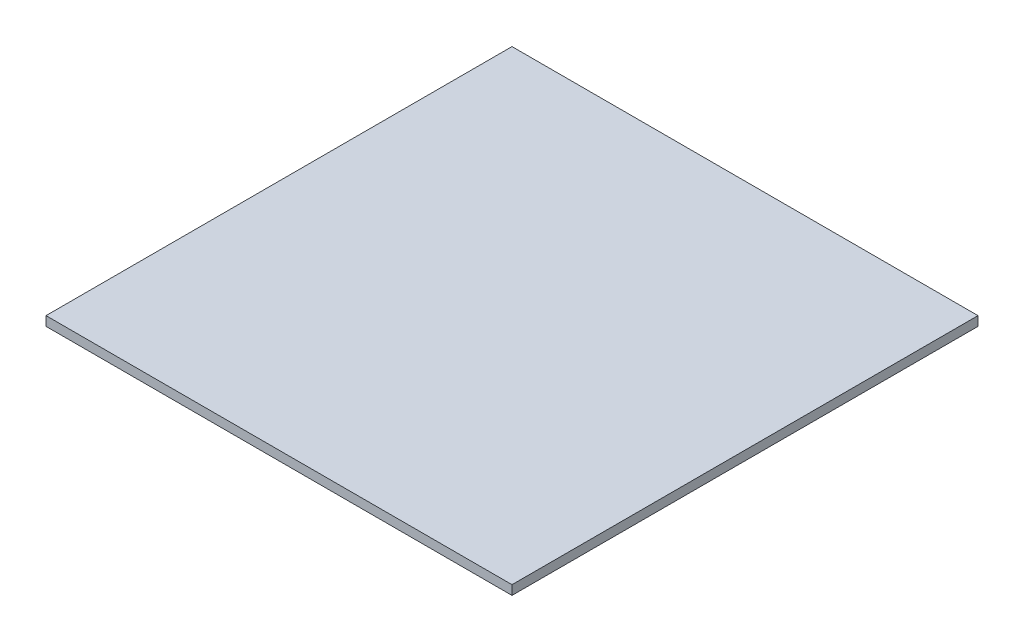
from build123d import *

# Parameters (mm, degrees)
SKETCH1_W           = 1270
SKETCH1_H           = 1270
BOSS_EXTRUDE1_DEPTH = 25.4


with BuildPart() as part:
    # Sketch1 → Boss-Extrude1 (new body)
    with BuildSketch(Plane(origin=(0, 0, 0), x_dir=(1, 0, 0), z_dir=(0, 1, 0))):
        with Locations((635, 635)):
            Rectangle(SKETCH1_W, SKETCH1_H)
    extrude(amount=BOSS_EXTRUDE1_DEPTH)


solid = part.part
